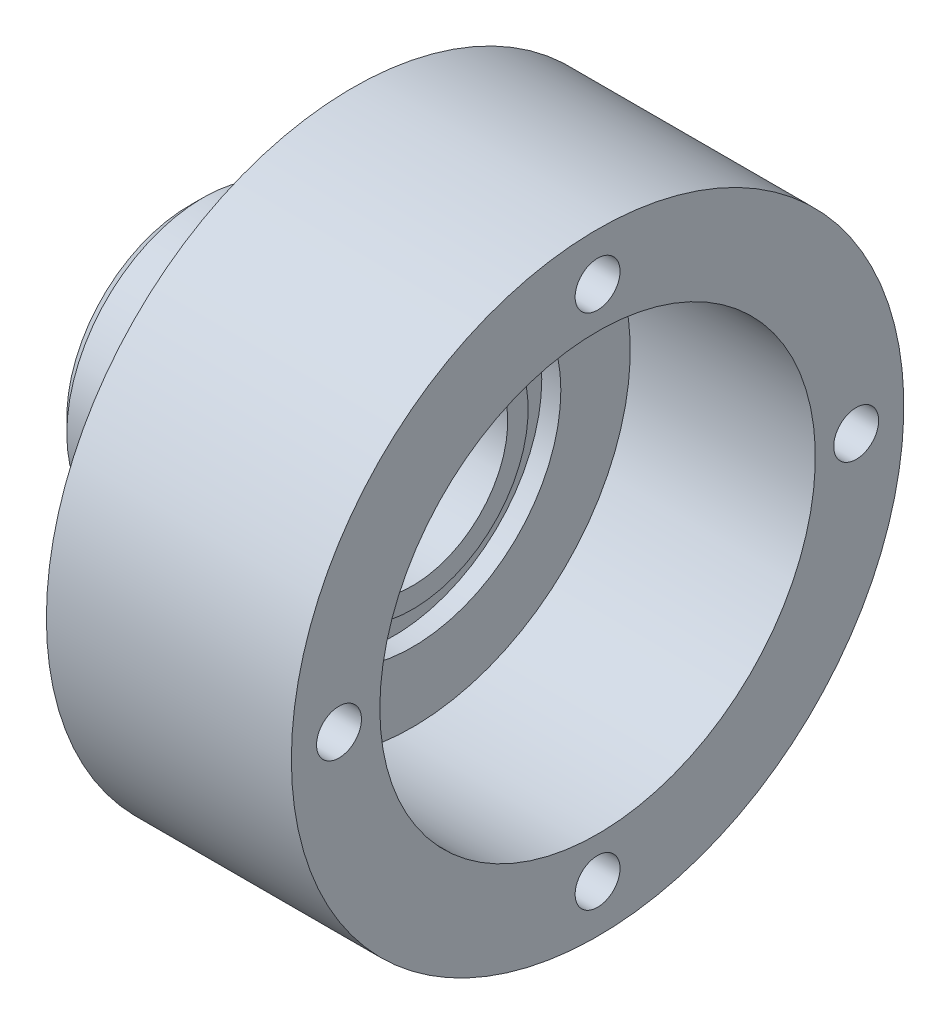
ISO-10303-21;
HEADER;
FILE_DESCRIPTION(('STEP AP214'),'2;1');
FILE_NAME('part.step','',(''),(''),'','','');
FILE_SCHEMA(('AUTOMOTIVE_DESIGN { 1 0 10303 214 1 1 1 1 }'));
ENDSEC;
DATA;
#1=APPLICATION_CONTEXT('core data for automotive mechanical design processes');
#2=APPLICATION_PROTOCOL_DEFINITION('international standard','automotive_design',2000,#1);
#3=PRODUCT_CONTEXT('',#1,'mechanical');
#4=PRODUCT('Part','Part','',(#3));
#5=PRODUCT_RELATED_PRODUCT_CATEGORY('part','',(#4));
#6=PRODUCT_DEFINITION_FORMATION('','',#4);
#7=PRODUCT_DEFINITION_CONTEXT('part definition',#1,'design');
#8=PRODUCT_DEFINITION('design','',#6,#7);
#9=PRODUCT_DEFINITION_SHAPE('','',#8);
#10=(LENGTH_UNIT() NAMED_UNIT(*) SI_UNIT(.MILLI.,.METRE.));
#11=(NAMED_UNIT(*) PLANE_ANGLE_UNIT() SI_UNIT($,.RADIAN.));
#12=(NAMED_UNIT(*) SI_UNIT($,.STERADIAN.) SOLID_ANGLE_UNIT());
#13=UNCERTAINTY_MEASURE_WITH_UNIT(LENGTH_MEASURE(1.E-05),#10,'distance_accuracy_value','');
#14=(GEOMETRIC_REPRESENTATION_CONTEXT(3) GLOBAL_UNCERTAINTY_ASSIGNED_CONTEXT((#13)) GLOBAL_UNIT_ASSIGNED_CONTEXT((#10,
#11,#12)) REPRESENTATION_CONTEXT('',''));
#15=CARTESIAN_POINT('',(0.,0.,0.));
#16=DIRECTION('',(0.,0.,1.));
#17=DIRECTION('',(1.,0.,0.));
#18=AXIS2_PLACEMENT_3D('',#15,#16,#17);
#19=CARTESIAN_POINT('',(-25.5557009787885,0.,0.));
#20=DIRECTION('',(-1.,0.,0.));
#21=DIRECTION('',(0.,0.,1.));
#22=AXIS2_PLACEMENT_3D('',#19,#20,#21);
#23=CYLINDRICAL_SURFACE('',#22,9.99999999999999);
#24=CARTESIAN_POINT('',(9.,0.,0.));
#25=DIRECTION('',(-1.,0.,0.));
#26=DIRECTION('',(0.,0.,1.));
#27=AXIS2_PLACEMENT_3D('',#24,#25,#26);
#28=CIRCLE('',#27,9.99999999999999);
#29=CARTESIAN_POINT('',(9.,0.,9.99999999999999));
#30=VERTEX_POINT('',#29);
#31=EDGE_CURVE('E40',#30,#30,#28,.T.);
#32=ORIENTED_EDGE('',*,*,#31,.T.);
#33=EDGE_LOOP('',(#32));
#34=FACE_BOUND('',#33,.T.);
#35=CARTESIAN_POINT('',(1.00000000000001,0.,0.));
#36=DIRECTION('',(1.,0.,0.));
#37=DIRECTION('',(0.,0.,-1.));
#38=AXIS2_PLACEMENT_3D('',#35,#36,#37);
#39=CIRCLE('',#38,9.99999999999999);
#40=CARTESIAN_POINT('',(1.00000000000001,0.,-9.99999999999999));
#41=VERTEX_POINT('',#40);
#42=EDGE_CURVE('E134',#41,#41,#39,.T.);
#43=ORIENTED_EDGE('',*,*,#42,.T.);
#44=EDGE_LOOP('',(#43));
#45=FACE_BOUND('',#44,.T.);
#46=ADVANCED_FACE('F32',(#34,#45),#23,.T.);
#47=CARTESIAN_POINT('',(-25.5557009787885,0.,0.));
#48=DIRECTION('',(-1.,0.,0.));
#49=DIRECTION('',(0.,0.,1.));
#50=AXIS2_PLACEMENT_3D('',#47,#48,#49);
#51=CYLINDRICAL_SURFACE('',#50,9.);
#52=CARTESIAN_POINT('',(10.,0.,0.));
#53=DIRECTION('',(-1.,0.,0.));
#54=DIRECTION('',(0.,0.,1.));
#55=AXIS2_PLACEMENT_3D('',#52,#53,#54);
#56=CIRCLE('',#55,9.);
#57=CARTESIAN_POINT('',(10.,0.,9.));
#58=VERTEX_POINT('',#57);
#59=EDGE_CURVE('E131',#58,#58,#56,.T.);
#60=ORIENTED_EDGE('',*,*,#59,.F.);
#61=EDGE_LOOP('',(#60));
#62=FACE_BOUND('',#61,.T.);
#63=CARTESIAN_POINT('',(12.,0.,0.));
#64=DIRECTION('',(-1.,0.,0.));
#65=DIRECTION('',(0.,0.,1.));
#66=AXIS2_PLACEMENT_3D('',#63,#64,#65);
#67=CIRCLE('',#66,9.);
#68=CARTESIAN_POINT('',(12.,0.,9.));
#69=VERTEX_POINT('',#68);
#70=EDGE_CURVE('E128',#69,#69,#67,.T.);
#71=ORIENTED_EDGE('',*,*,#70,.T.);
#72=EDGE_LOOP('',(#71));
#73=FACE_BOUND('',#72,.T.);
#74=ADVANCED_FACE('F152',(#62,#73),#51,.T.);
#75=CARTESIAN_POINT('',(12.,9.,0.));
#76=DIRECTION('',(1.,0.,0.));
#77=DIRECTION('',(0.,0.,-1.));
#78=AXIS2_PLACEMENT_3D('',#75,#76,#77);
#79=PLANE('',#78);
#80=ORIENTED_EDGE('',*,*,#70,.F.);
#81=EDGE_LOOP('',(#80));
#82=FACE_BOUND('',#81,.T.);
#83=CARTESIAN_POINT('',(12.,0.,0.));
#84=DIRECTION('',(-1.,0.,0.));
#85=DIRECTION('',(0.,0.,1.));
#86=AXIS2_PLACEMENT_3D('',#83,#84,#85);
#87=CIRCLE('',#86,11.15);
#88=CARTESIAN_POINT('',(12.,0.,11.15));
#89=VERTEX_POINT('',#88);
#90=EDGE_CURVE('E125',#89,#89,#87,.T.);
#91=ORIENTED_EDGE('',*,*,#90,.T.);
#92=EDGE_LOOP('',(#91));
#93=FACE_BOUND('',#92,.T.);
#94=ADVANCED_FACE('F156',(#82,#93),#79,.F.);
#95=CARTESIAN_POINT('',(-25.5557009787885,0.,0.));
#96=DIRECTION('',(-1.,0.,0.));
#97=DIRECTION('',(0.,0.,1.));
#98=AXIS2_PLACEMENT_3D('',#95,#96,#97);
#99=CYLINDRICAL_SURFACE('',#98,11.15);
#100=ORIENTED_EDGE('',*,*,#90,.F.);
#101=EDGE_LOOP('',(#100));
#102=FACE_BOUND('',#101,.T.);
#103=CARTESIAN_POINT('',(13.4,0.,0.));
#104=DIRECTION('',(-1.,0.,0.));
#105=DIRECTION('',(0.,0.,1.));
#106=AXIS2_PLACEMENT_3D('',#103,#104,#105);
#107=CIRCLE('',#106,11.15);
#108=CARTESIAN_POINT('',(13.4,0.,11.15));
#109=VERTEX_POINT('',#108);
#110=EDGE_CURVE('E122',#109,#109,#107,.T.);
#111=ORIENTED_EDGE('',*,*,#110,.T.);
#112=EDGE_LOOP('',(#111));
#113=FACE_BOUND('',#112,.T.);
#114=ADVANCED_FACE('F162',(#102,#113),#99,.T.);
#115=CARTESIAN_POINT('',(13.4,11.15,0.));
#116=DIRECTION('',(1.,0.,0.));
#117=DIRECTION('',(0.,0.,-1.));
#118=AXIS2_PLACEMENT_3D('',#115,#116,#117);
#119=PLANE('',#118);
#120=ORIENTED_EDGE('',*,*,#110,.F.);
#121=EDGE_LOOP('',(#120));
#122=FACE_BOUND('',#121,.T.);
#123=CARTESIAN_POINT('',(13.4,0.,0.));
#124=DIRECTION('',(-1.,0.,0.));
#125=DIRECTION('',(0.,0.,1.));
#126=AXIS2_PLACEMENT_3D('',#123,#124,#125);
#127=CIRCLE('',#126,13.95);
#128=CARTESIAN_POINT('',(13.4,0.,13.95));
#129=VERTEX_POINT('',#128);
#130=EDGE_CURVE('E119',#129,#129,#127,.T.);
#131=ORIENTED_EDGE('',*,*,#130,.T.);
#132=EDGE_LOOP('',(#131));
#133=FACE_BOUND('',#132,.T.);
#134=ADVANCED_FACE('F166',(#122,#133),#119,.F.);
#135=CARTESIAN_POINT('',(-25.5557009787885,0.,0.));
#136=DIRECTION('',(-1.,0.,0.));
#137=DIRECTION('',(0.,0.,1.));
#138=AXIS2_PLACEMENT_3D('',#135,#136,#137);
#139=CYLINDRICAL_SURFACE('',#138,13.95);
#140=ORIENTED_EDGE('',*,*,#130,.F.);
#141=EDGE_LOOP('',(#140));
#142=FACE_BOUND('',#141,.T.);
#143=CARTESIAN_POINT('',(12.,0.,0.));
#144=DIRECTION('',(-1.,0.,0.));
#145=DIRECTION('',(0.,0.,1.));
#146=AXIS2_PLACEMENT_3D('',#143,#144,#145);
#147=CIRCLE('',#146,13.95);
#148=CARTESIAN_POINT('',(12.,0.,13.95));
#149=VERTEX_POINT('',#148);
#150=EDGE_CURVE('E116',#149,#149,#147,.T.);
#151=ORIENTED_EDGE('',*,*,#150,.T.);
#152=EDGE_LOOP('',(#151));
#153=FACE_BOUND('',#152,.T.);
#154=ADVANCED_FACE('F170',(#142,#153),#139,.F.);
#155=CARTESIAN_POINT('',(12.,13.95,0.));
#156=DIRECTION('',(1.,0.,0.));
#157=DIRECTION('',(0.,0.,-1.));
#158=AXIS2_PLACEMENT_3D('',#155,#156,#157);
#159=PLANE('',#158);
#160=ORIENTED_EDGE('',*,*,#150,.F.);
#161=EDGE_LOOP('',(#160));
#162=FACE_BOUND('',#161,.T.);
#163=CARTESIAN_POINT('',(12.,0.,0.));
#164=DIRECTION('',(-1.,0.,0.));
#165=DIRECTION('',(0.,0.,1.));
#166=AXIS2_PLACEMENT_3D('',#163,#164,#165);
#167=CIRCLE('',#166,22.5);
#168=CARTESIAN_POINT('',(12.,0.,22.5));
#169=VERTEX_POINT('',#168);
#170=EDGE_CURVE('E113',#169,#169,#167,.T.);
#171=ORIENTED_EDGE('',*,*,#170,.T.);
#172=EDGE_LOOP('',(#171));
#173=FACE_BOUND('',#172,.T.);
#174=ADVANCED_FACE('F174',(#162,#173),#159,.F.);
#175=CARTESIAN_POINT('',(-25.5557009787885,0.,0.));
#176=DIRECTION('',(-1.,0.,0.));
#177=DIRECTION('',(0.,0.,1.));
#178=AXIS2_PLACEMENT_3D('',#175,#176,#177);
#179=CYLINDRICAL_SURFACE('',#178,22.5);
#180=ORIENTED_EDGE('',*,*,#170,.F.);
#181=EDGE_LOOP('',(#180));
#182=FACE_BOUND('',#181,.T.);
#183=CARTESIAN_POINT('',(30.,0.,0.));
#184=DIRECTION('',(-1.,0.,0.));
#185=DIRECTION('',(0.,0.,1.));
#186=AXIS2_PLACEMENT_3D('',#183,#184,#185);
#187=CIRCLE('',#186,22.5);
#188=CARTESIAN_POINT('',(30.,0.,22.5));
#189=VERTEX_POINT('',#188);
#190=EDGE_CURVE('E110',#189,#189,#187,.T.);
#191=ORIENTED_EDGE('',*,*,#190,.T.);
#192=EDGE_LOOP('',(#191));
#193=FACE_BOUND('',#192,.T.);
#194=ADVANCED_FACE('F178',(#182,#193),#179,.T.);
#195=CARTESIAN_POINT('',(30.,22.5,0.));
#196=DIRECTION('',(-1.,0.,0.));
#197=DIRECTION('',(0.,0.,1.));
#198=AXIS2_PLACEMENT_3D('',#195,#196,#197);
#199=PLANE('',#198);
#200=CARTESIAN_POINT('',(30.,19.,0.));
#201=DIRECTION('',(1.,0.,0.));
#202=DIRECTION('',(0.,0.,-1.));
#203=AXIS2_PLACEMENT_3D('',#200,#201,#202);
#204=CIRCLE('',#203,1.65);
#205=CARTESIAN_POINT('',(30.,19.,-1.65));
#206=VERTEX_POINT('',#205);
#207=EDGE_CURVE('E64',#206,#206,#204,.T.);
#208=ORIENTED_EDGE('',*,*,#207,.F.);
#209=EDGE_LOOP('',(#208));
#210=FACE_BOUND('',#209,.T.);
#211=CARTESIAN_POINT('',(30.,0.,-19.));
#212=DIRECTION('',(1.,0.,0.));
#213=DIRECTION('',(0.,0.,-1.));
#214=AXIS2_PLACEMENT_3D('',#211,#212,#213);
#215=CIRCLE('',#214,1.65);
#216=CARTESIAN_POINT('',(30.,0.,-20.65));
#217=VERTEX_POINT('',#216);
#218=EDGE_CURVE('E63',#217,#217,#215,.T.);
#219=ORIENTED_EDGE('',*,*,#218,.F.);
#220=EDGE_LOOP('',(#219));
#221=FACE_BOUND('',#220,.T.);
#222=CARTESIAN_POINT('',(30.,-19.,0.));
#223=DIRECTION('',(1.,0.,0.));
#224=DIRECTION('',(0.,0.,-1.));
#225=AXIS2_PLACEMENT_3D('',#222,#223,#224);
#226=CIRCLE('',#225,1.65);
#227=CARTESIAN_POINT('',(30.,-19.,-1.65));
#228=VERTEX_POINT('',#227);
#229=EDGE_CURVE('E74',#228,#228,#226,.T.);
#230=ORIENTED_EDGE('',*,*,#229,.F.);
#231=EDGE_LOOP('',(#230));
#232=FACE_BOUND('',#231,.T.);
#233=CARTESIAN_POINT('',(30.,0.,19.));
#234=DIRECTION('',(1.,0.,0.));
#235=DIRECTION('',(0.,0.,-1.));
#236=AXIS2_PLACEMENT_3D('',#233,#234,#235);
#237=CIRCLE('',#236,1.65);
#238=CARTESIAN_POINT('',(30.,0.,17.35));
#239=VERTEX_POINT('',#238);
#240=EDGE_CURVE('E80',#239,#239,#237,.T.);
#241=ORIENTED_EDGE('',*,*,#240,.F.);
#242=EDGE_LOOP('',(#241));
#243=FACE_BOUND('',#242,.T.);
#244=ORIENTED_EDGE('',*,*,#190,.F.);
#245=EDGE_LOOP('',(#244));
#246=FACE_BOUND('',#245,.T.);
#247=CARTESIAN_POINT('',(30.,0.,0.));
#248=DIRECTION('',(-1.,0.,0.));
#249=DIRECTION('',(0.,0.,1.));
#250=AXIS2_PLACEMENT_3D('',#247,#248,#249);
#251=CIRCLE('',#250,16.);
#252=CARTESIAN_POINT('',(30.,0.,16.));
#253=VERTEX_POINT('',#252);
#254=EDGE_CURVE('E107',#253,#253,#251,.T.);
#255=ORIENTED_EDGE('',*,*,#254,.T.);
#256=EDGE_LOOP('',(#255));
#257=FACE_BOUND('',#256,.T.);
#258=ADVANCED_FACE('F182',(#210,#221,#232,#243,#246,#257),#199,.F.);
#259=CARTESIAN_POINT('',(-25.5557009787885,0.,0.));
#260=DIRECTION('',(-1.,0.,0.));
#261=DIRECTION('',(0.,0.,1.));
#262=AXIS2_PLACEMENT_3D('',#259,#260,#261);
#263=CYLINDRICAL_SURFACE('',#262,16.);
#264=ORIENTED_EDGE('',*,*,#254,.F.);
#265=EDGE_LOOP('',(#264));
#266=FACE_BOUND('',#265,.T.);
#267=CARTESIAN_POINT('',(16.4,0.,0.));
#268=DIRECTION('',(-1.,0.,0.));
#269=DIRECTION('',(0.,0.,1.));
#270=AXIS2_PLACEMENT_3D('',#267,#268,#269);
#271=CIRCLE('',#270,16.);
#272=CARTESIAN_POINT('',(16.4,0.,16.));
#273=VERTEX_POINT('',#272);
#274=EDGE_CURVE('E104',#273,#273,#271,.T.);
#275=ORIENTED_EDGE('',*,*,#274,.T.);
#276=EDGE_LOOP('',(#275));
#277=FACE_BOUND('',#276,.T.);
#278=ADVANCED_FACE('F186',(#266,#277),#263,.F.);
#279=CARTESIAN_POINT('',(16.4,10.9,0.));
#280=DIRECTION('',(-1.,0.,0.));
#281=DIRECTION('',(0.,0.,1.));
#282=AXIS2_PLACEMENT_3D('',#279,#280,#281);
#283=PLANE('',#282);
#284=ORIENTED_EDGE('',*,*,#274,.F.);
#285=EDGE_LOOP('',(#284));
#286=FACE_BOUND('',#285,.T.);
#287=CARTESIAN_POINT('',(16.4,0.,0.));
#288=DIRECTION('',(-1.,0.,0.));
#289=DIRECTION('',(0.,0.,1.));
#290=AXIS2_PLACEMENT_3D('',#287,#288,#289);
#291=CIRCLE('',#290,10.9);
#292=CARTESIAN_POINT('',(16.4,0.,10.9));
#293=VERTEX_POINT('',#292);
#294=EDGE_CURVE('E101',#293,#293,#291,.T.);
#295=ORIENTED_EDGE('',*,*,#294,.T.);
#296=EDGE_LOOP('',(#295));
#297=FACE_BOUND('',#296,.T.);
#298=ADVANCED_FACE('F190',(#286,#297),#283,.F.);
#299=CARTESIAN_POINT('',(-25.5557009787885,0.,0.));
#300=DIRECTION('',(-1.,0.,0.));
#301=DIRECTION('',(0.,0.,1.));
#302=AXIS2_PLACEMENT_3D('',#299,#300,#301);
#303=CYLINDRICAL_SURFACE('',#302,10.9);
#304=ORIENTED_EDGE('',*,*,#294,.F.);
#305=EDGE_LOOP('',(#304));
#306=FACE_BOUND('',#305,.T.);
#307=CARTESIAN_POINT('',(15.,0.,0.));
#308=DIRECTION('',(-1.,0.,0.));
#309=DIRECTION('',(0.,0.,1.));
#310=AXIS2_PLACEMENT_3D('',#307,#308,#309);
#311=CIRCLE('',#310,10.9);
#312=CARTESIAN_POINT('',(15.,0.,10.9));
#313=VERTEX_POINT('',#312);
#314=EDGE_CURVE('E98',#313,#313,#311,.T.);
#315=ORIENTED_EDGE('',*,*,#314,.T.);
#316=EDGE_LOOP('',(#315));
#317=FACE_BOUND('',#316,.T.);
#318=ADVANCED_FACE('F194',(#306,#317),#303,.F.);
#319=CARTESIAN_POINT('',(15.,8.5,0.));
#320=DIRECTION('',(-1.,0.,0.));
#321=DIRECTION('',(0.,0.,1.));
#322=AXIS2_PLACEMENT_3D('',#319,#320,#321);
#323=PLANE('',#322);
#324=ORIENTED_EDGE('',*,*,#314,.F.);
#325=EDGE_LOOP('',(#324));
#326=FACE_BOUND('',#325,.T.);
#327=CARTESIAN_POINT('',(15.,0.,0.));
#328=DIRECTION('',(-1.,0.,0.));
#329=DIRECTION('',(0.,0.,1.));
#330=AXIS2_PLACEMENT_3D('',#327,#328,#329);
#331=CIRCLE('',#330,8.5);
#332=CARTESIAN_POINT('',(15.,0.,8.5));
#333=VERTEX_POINT('',#332);
#334=EDGE_CURVE('E95',#333,#333,#331,.T.);
#335=ORIENTED_EDGE('',*,*,#334,.T.);
#336=EDGE_LOOP('',(#335));
#337=FACE_BOUND('',#336,.T.);
#338=ADVANCED_FACE('F198',(#326,#337),#323,.F.);
#339=CARTESIAN_POINT('',(-25.5557009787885,0.,0.));
#340=DIRECTION('',(-1.,0.,0.));
#341=DIRECTION('',(0.,0.,1.));
#342=AXIS2_PLACEMENT_3D('',#339,#340,#341);
#343=CYLINDRICAL_SURFACE('',#342,8.5);
#344=ORIENTED_EDGE('',*,*,#334,.F.);
#345=EDGE_LOOP('',(#344));
#346=FACE_BOUND('',#345,.T.);
#347=CARTESIAN_POINT('',(16.4,0.,0.));
#348=DIRECTION('',(-1.,0.,0.));
#349=DIRECTION('',(0.,0.,1.));
#350=AXIS2_PLACEMENT_3D('',#347,#348,#349);
#351=CIRCLE('',#350,8.5);
#352=CARTESIAN_POINT('',(16.4,0.,8.5));
#353=VERTEX_POINT('',#352);
#354=EDGE_CURVE('E92',#353,#353,#351,.T.);
#355=ORIENTED_EDGE('',*,*,#354,.T.);
#356=EDGE_LOOP('',(#355));
#357=FACE_BOUND('',#356,.T.);
#358=ADVANCED_FACE('F202',(#346,#357),#343,.T.);
#359=CARTESIAN_POINT('',(16.4,7.,0.));
#360=DIRECTION('',(-1.,0.,0.));
#361=DIRECTION('',(0.,0.,1.));
#362=AXIS2_PLACEMENT_3D('',#359,#360,#361);
#363=PLANE('',#362);
#364=ORIENTED_EDGE('',*,*,#354,.F.);
#365=EDGE_LOOP('',(#364));
#366=FACE_BOUND('',#365,.T.);
#367=CARTESIAN_POINT('',(16.4,0.,0.));
#368=DIRECTION('',(-1.,0.,0.));
#369=DIRECTION('',(0.,0.,1.));
#370=AXIS2_PLACEMENT_3D('',#367,#368,#369);
#371=CIRCLE('',#370,7.);
#372=CARTESIAN_POINT('',(16.4,0.,7.));
#373=VERTEX_POINT('',#372);
#374=EDGE_CURVE('E89',#373,#373,#371,.T.);
#375=ORIENTED_EDGE('',*,*,#374,.T.);
#376=EDGE_LOOP('',(#375));
#377=FACE_BOUND('',#376,.T.);
#378=ADVANCED_FACE('F206',(#366,#377),#363,.F.);
#379=CARTESIAN_POINT('',(-25.5557009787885,0.,0.));
#380=DIRECTION('',(-1.,0.,0.));
#381=DIRECTION('',(0.,0.,1.));
#382=AXIS2_PLACEMENT_3D('',#379,#380,#381);
#383=CYLINDRICAL_SURFACE('',#382,7.);
#384=ORIENTED_EDGE('',*,*,#374,.F.);
#385=EDGE_LOOP('',(#384));
#386=FACE_BOUND('',#385,.T.);
#387=CARTESIAN_POINT('',(0.,0.,0.));
#388=DIRECTION('',(-1.,0.,0.));
#389=DIRECTION('',(0.,0.,1.));
#390=AXIS2_PLACEMENT_3D('',#387,#388,#389);
#391=CIRCLE('',#390,7.);
#392=CARTESIAN_POINT('',(0.,0.,7.));
#393=VERTEX_POINT('',#392);
#394=EDGE_CURVE('E86',#393,#393,#391,.T.);
#395=ORIENTED_EDGE('',*,*,#394,.T.);
#396=EDGE_LOOP('',(#395));
#397=FACE_BOUND('',#396,.T.);
#398=ADVANCED_FACE('F210',(#386,#397),#383,.F.);
#399=CARTESIAN_POINT('',(0.,7.,0.));
#400=DIRECTION('',(1.,0.,0.));
#401=DIRECTION('',(0.,0.,-1.));
#402=AXIS2_PLACEMENT_3D('',#399,#400,#401);
#403=PLANE('',#402);
#404=CARTESIAN_POINT('',(0.,0.,0.));
#405=DIRECTION('',(1.,0.,0.));
#406=DIRECTION('',(0.,0.,-1.));
#407=AXIS2_PLACEMENT_3D('',#404,#405,#406);
#408=CIRCLE('',#407,8.99999999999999);
#409=CARTESIAN_POINT('',(0.,0.,-8.99999999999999));
#410=VERTEX_POINT('',#409);
#411=EDGE_CURVE('E11',#410,#410,#408,.F.);
#412=ORIENTED_EDGE('',*,*,#411,.T.);
#413=EDGE_LOOP('',(#412));
#414=FACE_BOUND('',#413,.T.);
#415=ORIENTED_EDGE('',*,*,#394,.F.);
#416=EDGE_LOOP('',(#415));
#417=FACE_BOUND('',#416,.T.);
#418=ADVANCED_FACE('F214',(#414,#417),#403,.F.);
#419=CARTESIAN_POINT('',(18.,0.,19.));
#420=DIRECTION('',(1.,0.,0.));
#421=DIRECTION('',(0.,0.,-1.));
#422=AXIS2_PLACEMENT_3D('',#419,#420,#421);
#423=CONICAL_SURFACE('',#422,1.65,1.02974425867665);
#424=CARTESIAN_POINT('',(17.0085799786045,0.,19.));
#425=VERTEX_POINT('',#424);
#426=VERTEX_LOOP('',#425);
#427=FACE_BOUND('',#426,.T.);
#428=CARTESIAN_POINT('',(18.,0.,19.));
#429=DIRECTION('',(1.,0.,0.));
#430=DIRECTION('',(0.,0.,-1.));
#431=AXIS2_PLACEMENT_3D('',#428,#429,#430);
#432=CIRCLE('',#431,1.65);
#433=CARTESIAN_POINT('',(18.,0.,17.35));
#434=VERTEX_POINT('',#433);
#435=EDGE_CURVE('E83',#434,#434,#432,.T.);
#436=ORIENTED_EDGE('',*,*,#435,.T.);
#437=EDGE_LOOP('',(#436));
#438=FACE_BOUND('',#437,.T.);
#439=ADVANCED_FACE('F218',(#427,#438),#423,.F.);
#440=CARTESIAN_POINT('',(30.,0.,19.));
#441=DIRECTION('',(1.,0.,0.));
#442=DIRECTION('',(0.,0.,-1.));
#443=AXIS2_PLACEMENT_3D('',#440,#441,#442);
#444=CYLINDRICAL_SURFACE('',#443,1.65);
#445=ORIENTED_EDGE('',*,*,#435,.F.);
#446=EDGE_LOOP('',(#445));
#447=FACE_BOUND('',#446,.T.);
#448=ORIENTED_EDGE('',*,*,#240,.T.);
#449=EDGE_LOOP('',(#448));
#450=FACE_BOUND('',#449,.T.);
#451=ADVANCED_FACE('F222',(#447,#450),#444,.F.);
#452=CARTESIAN_POINT('',(18.,-19.,0.));
#453=DIRECTION('',(1.,0.,0.));
#454=DIRECTION('',(0.,0.,-1.));
#455=AXIS2_PLACEMENT_3D('',#452,#453,#454);
#456=CONICAL_SURFACE('',#455,1.65,1.02974425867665);
#457=CARTESIAN_POINT('',(17.0085799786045,-19.,0.));
#458=VERTEX_POINT('',#457);
#459=VERTEX_LOOP('',#458);
#460=FACE_BOUND('',#459,.T.);
#461=CARTESIAN_POINT('',(18.,-19.,0.));
#462=DIRECTION('',(1.,0.,0.));
#463=DIRECTION('',(0.,0.,-1.));
#464=AXIS2_PLACEMENT_3D('',#461,#462,#463);
#465=CIRCLE('',#464,1.65);
#466=CARTESIAN_POINT('',(18.,-19.,-1.65));
#467=VERTEX_POINT('',#466);
#468=EDGE_CURVE('E77',#467,#467,#465,.T.);
#469=ORIENTED_EDGE('',*,*,#468,.T.);
#470=EDGE_LOOP('',(#469));
#471=FACE_BOUND('',#470,.T.);
#472=ADVANCED_FACE('F225',(#460,#471),#456,.F.);
#473=CARTESIAN_POINT('',(30.,-19.,0.));
#474=DIRECTION('',(1.,0.,0.));
#475=DIRECTION('',(0.,0.,-1.));
#476=AXIS2_PLACEMENT_3D('',#473,#474,#475);
#477=CYLINDRICAL_SURFACE('',#476,1.65);
#478=ORIENTED_EDGE('',*,*,#468,.F.);
#479=EDGE_LOOP('',(#478));
#480=FACE_BOUND('',#479,.T.);
#481=ORIENTED_EDGE('',*,*,#229,.T.);
#482=EDGE_LOOP('',(#481));
#483=FACE_BOUND('',#482,.T.);
#484=ADVANCED_FACE('F229',(#480,#483),#477,.F.);
#485=CARTESIAN_POINT('',(18.,0.,-19.));
#486=DIRECTION('',(1.,0.,0.));
#487=DIRECTION('',(0.,0.,-1.));
#488=AXIS2_PLACEMENT_3D('',#485,#486,#487);
#489=CONICAL_SURFACE('',#488,1.65,1.02974425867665);
#490=CARTESIAN_POINT('',(17.0085799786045,0.,-19.));
#491=VERTEX_POINT('',#490);
#492=VERTEX_LOOP('',#491);
#493=FACE_BOUND('',#492,.T.);
#494=CARTESIAN_POINT('',(18.,0.,-19.));
#495=DIRECTION('',(1.,0.,0.));
#496=DIRECTION('',(0.,0.,-1.));
#497=AXIS2_PLACEMENT_3D('',#494,#495,#496);
#498=CIRCLE('',#497,1.65);
#499=CARTESIAN_POINT('',(18.,0.,-20.65));
#500=VERTEX_POINT('',#499);
#501=EDGE_CURVE('E67',#500,#500,#498,.T.);
#502=ORIENTED_EDGE('',*,*,#501,.T.);
#503=EDGE_LOOP('',(#502));
#504=FACE_BOUND('',#503,.T.);
#505=ADVANCED_FACE('F232',(#493,#504),#489,.F.);
#506=CARTESIAN_POINT('',(30.,0.,-19.));
#507=DIRECTION('',(1.,0.,0.));
#508=DIRECTION('',(0.,0.,-1.));
#509=AXIS2_PLACEMENT_3D('',#506,#507,#508);
#510=CYLINDRICAL_SURFACE('',#509,1.65);
#511=ORIENTED_EDGE('',*,*,#501,.F.);
#512=EDGE_LOOP('',(#511));
#513=FACE_BOUND('',#512,.T.);
#514=ORIENTED_EDGE('',*,*,#218,.T.);
#515=EDGE_LOOP('',(#514));
#516=FACE_BOUND('',#515,.T.);
#517=ADVANCED_FACE('F57',(#513,#516),#510,.F.);
#518=CARTESIAN_POINT('',(18.,19.,0.));
#519=DIRECTION('',(1.,0.,0.));
#520=DIRECTION('',(0.,0.,-1.));
#521=AXIS2_PLACEMENT_3D('',#518,#519,#520);
#522=CONICAL_SURFACE('',#521,1.65,1.02974425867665);
#523=CARTESIAN_POINT('',(17.0085799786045,19.,0.));
#524=VERTEX_POINT('',#523);
#525=VERTEX_LOOP('',#524);
#526=FACE_BOUND('',#525,.T.);
#527=CARTESIAN_POINT('',(18.,19.,0.));
#528=DIRECTION('',(1.,0.,0.));
#529=DIRECTION('',(0.,0.,-1.));
#530=AXIS2_PLACEMENT_3D('',#527,#528,#529);
#531=CIRCLE('',#530,1.65);
#532=CARTESIAN_POINT('',(18.,19.,-1.65));
#533=VERTEX_POINT('',#532);
#534=EDGE_CURVE('E61',#533,#533,#531,.T.);
#535=ORIENTED_EDGE('',*,*,#534,.T.);
#536=EDGE_LOOP('',(#535));
#537=FACE_BOUND('',#536,.T.);
#538=ADVANCED_FACE('F53',(#526,#537),#522,.F.);
#539=CARTESIAN_POINT('',(30.,19.,0.));
#540=DIRECTION('',(1.,0.,0.));
#541=DIRECTION('',(0.,0.,-1.));
#542=AXIS2_PLACEMENT_3D('',#539,#540,#541);
#543=CYLINDRICAL_SURFACE('',#542,1.65);
#544=ORIENTED_EDGE('',*,*,#534,.F.);
#545=EDGE_LOOP('',(#544));
#546=FACE_BOUND('',#545,.T.);
#547=ORIENTED_EDGE('',*,*,#207,.T.);
#548=EDGE_LOOP('',(#547));
#549=FACE_BOUND('',#548,.T.);
#550=ADVANCED_FACE('F56',(#546,#549),#543,.F.);
#551=CARTESIAN_POINT('',(9.,0.,0.));
#552=DIRECTION('',(-1.,0.,0.));
#553=DIRECTION('',(0.,0.,1.));
#554=AXIS2_PLACEMENT_3D('',#551,#552,#553);
#555=CONICAL_SURFACE('',#554,9.99999999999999,0.785398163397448);
#556=ORIENTED_EDGE('',*,*,#59,.T.);
#557=EDGE_LOOP('',(#556));
#558=FACE_BOUND('',#557,.T.);
#559=ORIENTED_EDGE('',*,*,#31,.F.);
#560=EDGE_LOOP('',(#559));
#561=FACE_BOUND('',#560,.T.);
#562=ADVANCED_FACE('F141',(#558,#561),#555,.T.);
#563=CARTESIAN_POINT('',(0.,0.,0.));
#564=DIRECTION('',(1.,0.,0.));
#565=DIRECTION('',(0.,0.,-1.));
#566=AXIS2_PLACEMENT_3D('',#563,#564,#565);
#567=CONICAL_SURFACE('',#566,8.99999999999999,0.785398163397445);
#568=ORIENTED_EDGE('',*,*,#42,.F.);
#569=EDGE_LOOP('',(#568));
#570=FACE_BOUND('',#569,.T.);
#571=ORIENTED_EDGE('',*,*,#411,.F.);
#572=EDGE_LOOP('',(#571));
#573=FACE_BOUND('',#572,.T.);
#574=ADVANCED_FACE('F34',(#570,#573),#567,.T.);
#575=CLOSED_SHELL('',(#46,#74,#94,#114,#134,#154,#174,#194,#258,#278,#298,#318,#338,#358,#378,
#398,#418,#439,#451,#472,#484,#505,#517,#538,#550,#562,#574));
#576=MANIFOLD_SOLID_BREP('B2',#575);
#577=ADVANCED_BREP_SHAPE_REPRESENTATION('',(#18,#576),#14);
#578=SHAPE_DEFINITION_REPRESENTATION(#9,#577);
ENDSEC;
END-ISO-10303-21;
